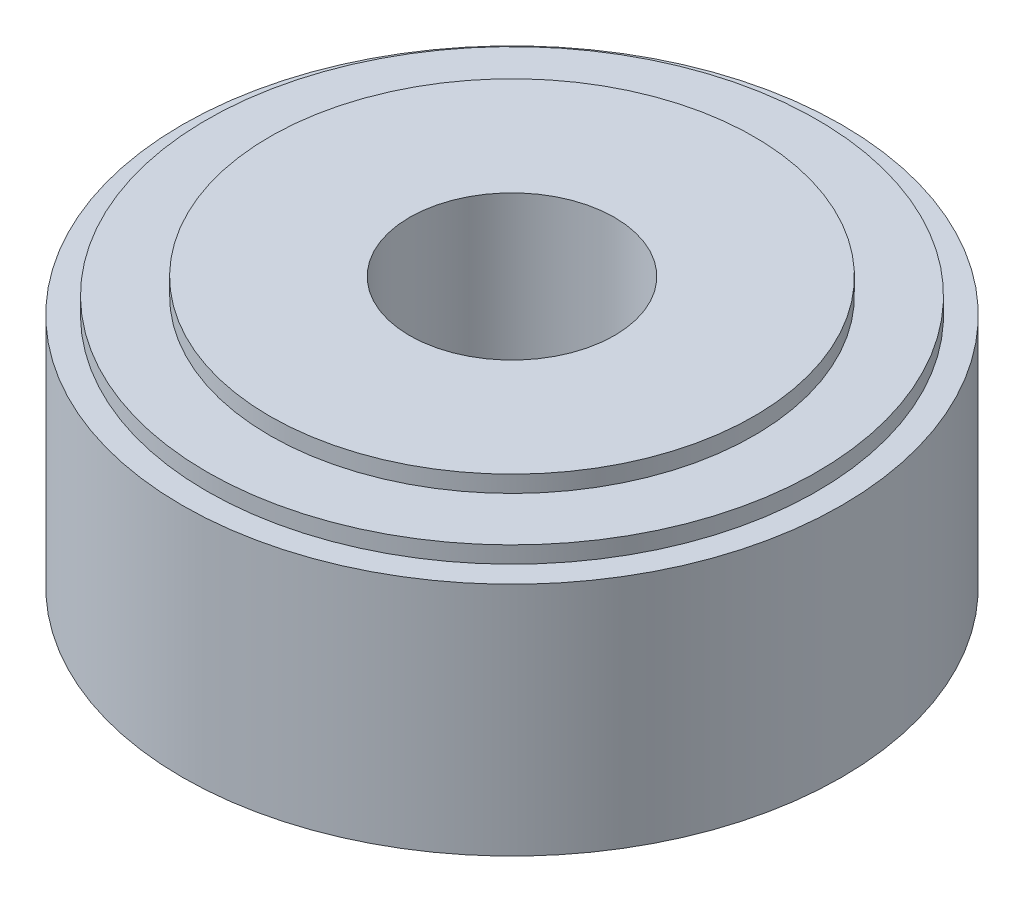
from build123d import *

# Parameters (mm, degrees)
SKETCH1_R           = 19.73
BOSS_EXTRUDE1_DEPTH = 7.045
SKETCH2_R           = 18.26
BOSS_EXTRUDE2_DEPTH = 1
SKETCH3_R           = 14.49
BOSS_EXTRUDE3_DEPTH = 1
CUT_EXTRUDE1_REACH  = 34.209
SKETCH4_R           = 6.13


with BuildPart() as part:
    # Sketch1 → Boss-Extrude1 (new, symmetric)
    with BuildSketch(Plane(origin=(0, 0, 0), x_dir=(1, 0, 0), z_dir=(0, 1, 0))):
        with Locations(Location((0, 0, 0), (0, 0, 270))):
            Circle(SKETCH1_R)
    extrude(amount=BOSS_EXTRUDE1_DEPTH, both=True)

    # Sketch2 → Boss-Extrude2 (add, symmetric)
    with BuildSketch(Plane(origin=(0, 7.045, 0), x_dir=(1, 0, 0), z_dir=(0, 1, 0))):
        with Locations(Location((0, 0, 0), (0, 0, 270))):
            Circle(SKETCH2_R)
    extrude(amount=BOSS_EXTRUDE2_DEPTH, both=True)

    # Sketch3 → Boss-Extrude3 (add, symmetric)
    with BuildSketch(Plane(origin=(0, 8.045, 0), x_dir=(1, 0, 0), z_dir=(0, 1, 0))):
        with Locations(Location((0, 0, 0), (0, 0, 270))):
            Circle(SKETCH3_R)
    extrude(amount=BOSS_EXTRUDE3_DEPTH, both=True)

    # Sketch4 → Cut-Extrude1 (cut, up to next)
    with BuildSketch(Plane(origin=(0, 9.045, 0), x_dir=(1, 0, 0), z_dir=(0, 1, 0)), mode=Mode.PRIVATE) as cut_extrude1_sk1:
        with Locations(Location((0, 0, 0), (0, 0, 270))):
            Circle(SKETCH4_R)
    cut_extrude1_tool1 = extrude(cut_extrude1_sk1.sketch, amount=-CUT_EXTRUDE1_REACH, mode=Mode.PRIVATE) & part.part
    add(cut_extrude1_tool1.solids().sort_by_distance((0, 9.045, 0))[0], mode=Mode.SUBTRACT)


solid = part.part
